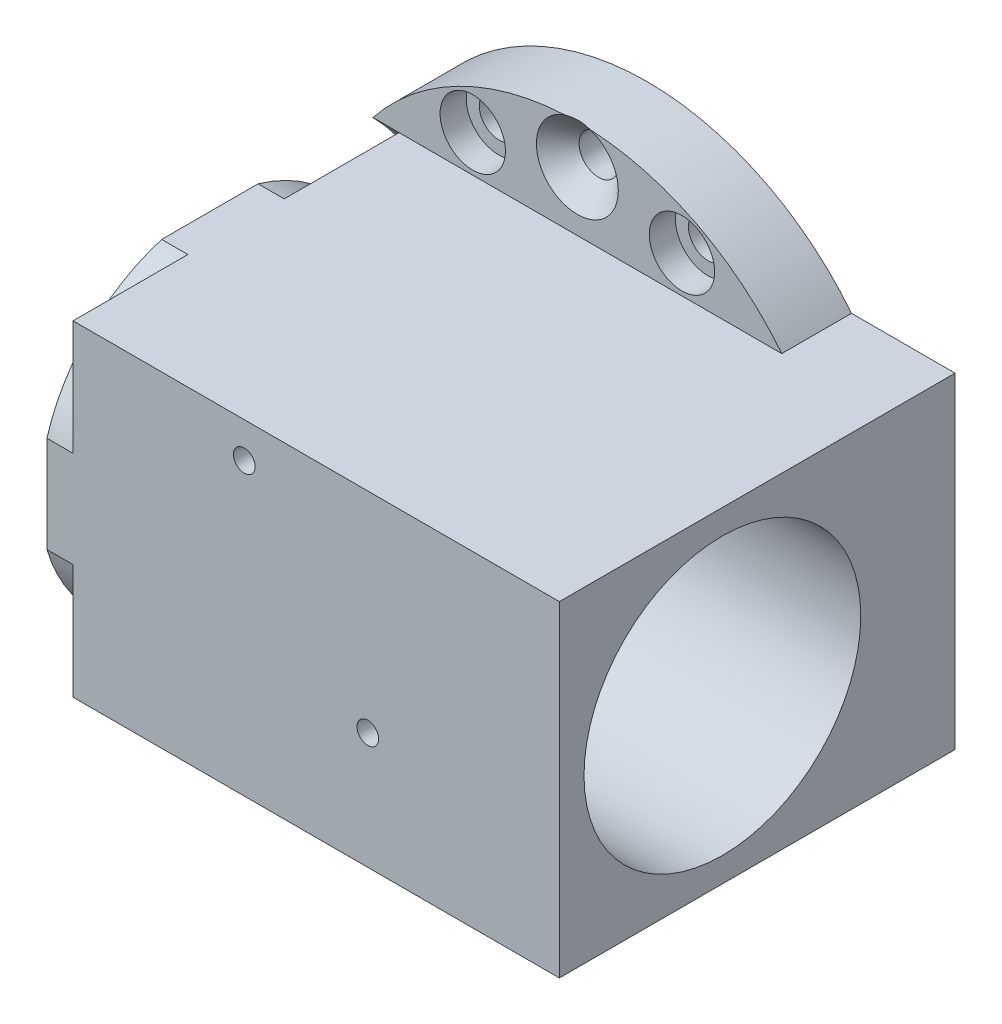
ISO-10303-21;
HEADER;
FILE_DESCRIPTION(('STEP AP214'),'2;1');
FILE_NAME('part.step','',(''),(''),'','','');
FILE_SCHEMA(('AUTOMOTIVE_DESIGN { 1 0 10303 214 1 1 1 1 }'));
ENDSEC;
DATA;
#1=APPLICATION_CONTEXT('core data for automotive mechanical design processes');
#2=APPLICATION_PROTOCOL_DEFINITION('international standard','automotive_design',2000,#1);
#3=PRODUCT_CONTEXT('',#1,'mechanical');
#4=PRODUCT('Part','Part','',(#3));
#5=PRODUCT_RELATED_PRODUCT_CATEGORY('part','',(#4));
#6=PRODUCT_DEFINITION_FORMATION('','',#4);
#7=PRODUCT_DEFINITION_CONTEXT('part definition',#1,'design');
#8=PRODUCT_DEFINITION('design','',#6,#7);
#9=PRODUCT_DEFINITION_SHAPE('','',#8);
#10=(LENGTH_UNIT() NAMED_UNIT(*) SI_UNIT(.MILLI.,.METRE.));
#11=(NAMED_UNIT(*) PLANE_ANGLE_UNIT() SI_UNIT($,.RADIAN.));
#12=(NAMED_UNIT(*) SI_UNIT($,.STERADIAN.) SOLID_ANGLE_UNIT());
#13=UNCERTAINTY_MEASURE_WITH_UNIT(LENGTH_MEASURE(1.E-05),#10,'distance_accuracy_value','');
#14=(GEOMETRIC_REPRESENTATION_CONTEXT(3) GLOBAL_UNCERTAINTY_ASSIGNED_CONTEXT((#13)) GLOBAL_UNIT_ASSIGNED_CONTEXT((#10,
#11,#12)) REPRESENTATION_CONTEXT('',''));
#15=CARTESIAN_POINT('',(0.,0.,0.));
#16=DIRECTION('',(0.,0.,1.));
#17=DIRECTION('',(1.,0.,0.));
#18=AXIS2_PLACEMENT_3D('',#15,#16,#17);
#19=CARTESIAN_POINT('',(-20.458687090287,0.,26.7));
#20=DIRECTION('',(1.,0.,0.));
#21=DIRECTION('',(0.,0.,-1.));
#22=AXIS2_PLACEMENT_3D('',#19,#20,#21);
#23=PLANE('',#22);
#24=CARTESIAN_POINT('',(-20.458687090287,0.,26.7));
#25=DIRECTION('',(-1.,0.,0.));
#26=DIRECTION('',(0.,0.,-1.));
#27=AXIS2_PLACEMENT_3D('',#24,#25,#26);
#28=CIRCLE('',#27,19.5);
#29=CARTESIAN_POINT('',(-20.458687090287,18.7,21.1718900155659));
#30=VERTEX_POINT('',#29);
#31=CARTESIAN_POINT('',(-20.458687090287,-18.7,21.1718900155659));
#32=VERTEX_POINT('',#31);
#33=EDGE_CURVE('E310',#30,#32,#28,.T.);
#34=ORIENTED_EDGE('',*,*,#33,.F.);
#35=DIRECTION('',(0.,0.,-1.));
#36=VECTOR('',#35,1.);
#37=CARTESIAN_POINT('',(-20.458687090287,18.7,45.4));
#38=LINE('',#37,#36);
#39=CARTESIAN_POINT('',(-20.458687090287,18.7,8.));
#40=VERTEX_POINT('',#39);
#41=EDGE_CURVE('E351',#30,#40,#38,.T.);
#42=ORIENTED_EDGE('',*,*,#41,.T.);
#43=CARTESIAN_POINT('',(-20.458687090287,0.,26.7));
#44=DIRECTION('',(1.,0.,0.));
#45=DIRECTION('',(0.,0.,-1.));
#46=AXIS2_PLACEMENT_3D('',#43,#44,#45);
#47=CIRCLE('',#46,26.4457936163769);
#48=CARTESIAN_POINT('',(-20.458687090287,-18.7,8.));
#49=VERTEX_POINT('',#48);
#50=EDGE_CURVE('E353',#49,#40,#47,.T.);
#51=ORIENTED_EDGE('',*,*,#50,.F.);
#52=DIRECTION('',(0.,0.,-1.));
#53=VECTOR('',#52,1.);
#54=CARTESIAN_POINT('',(-20.458687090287,-18.7,45.4));
#55=LINE('',#54,#53);
#56=EDGE_CURVE('E345',#32,#49,#55,.T.);
#57=ORIENTED_EDGE('',*,*,#56,.F.);
#58=EDGE_LOOP('',(#34,#42,#51,#57));
#59=FACE_BOUND('',#58,.T.);
#60=ADVANCED_FACE('F33',(#59),#23,.F.);
#61=CARTESIAN_POINT('',(0.,0.,8.));
#62=DIRECTION('',(0.,0.,1.));
#63=DIRECTION('',(1.,0.,0.));
#64=AXIS2_PLACEMENT_3D('',#61,#62,#63);
#65=PLANE('',#64);
#66=CARTESIAN_POINT('',(-12.,-22.95,8.));
#67=DIRECTION('',(0.,0.,1.));
#68=DIRECTION('',(1.,0.,0.));
#69=AXIS2_PLACEMENT_3D('',#66,#67,#68);
#70=CIRCLE('',#69,3.74999999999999);
#71=CARTESIAN_POINT('',(-8.25,-22.95,8.));
#72=VERTEX_POINT('',#71);
#73=EDGE_CURVE('E485',#72,#72,#70,.T.);
#74=ORIENTED_EDGE('',*,*,#73,.F.);
#75=EDGE_LOOP('',(#74));
#76=FACE_BOUND('',#75,.T.);
#77=CARTESIAN_POINT('',(12.,-22.95,8.));
#78=DIRECTION('',(0.,0.,1.));
#79=DIRECTION('',(1.,0.,0.));
#80=AXIS2_PLACEMENT_3D('',#77,#78,#79);
#81=CIRCLE('',#80,3.74999999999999);
#82=CARTESIAN_POINT('',(15.75,-22.95,8.));
#83=VERTEX_POINT('',#82);
#84=EDGE_CURVE('E473',#83,#83,#81,.T.);
#85=ORIENTED_EDGE('',*,*,#84,.F.);
#86=EDGE_LOOP('',(#85));
#87=FACE_BOUND('',#86,.T.);
#88=CARTESIAN_POINT('',(0.,-25.5,8.));
#89=DIRECTION('',(0.,0.,1.));
#90=DIRECTION('',(1.,0.,0.));
#91=AXIS2_PLACEMENT_3D('',#88,#89,#90);
#92=CIRCLE('',#91,4.69999999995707);
#93=CARTESIAN_POINT('',(1.47085153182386,-29.9639215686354,8.));
#94=VERTEX_POINT('',#93);
#95=CARTESIAN_POINT('',(-1.4708515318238,-29.9639215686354,8.));
#96=VERTEX_POINT('',#95);
#97=EDGE_CURVE('E58',#94,#96,#92,.T.);
#98=ORIENTED_EDGE('',*,*,#97,.F.);
#99=CARTESIAN_POINT('',(0.,0.,8.));
#100=DIRECTION('',(0.,0.,1.));
#101=DIRECTION('',(1.,0.,0.));
#102=AXIS2_PLACEMENT_3D('',#99,#100,#101);
#103=CIRCLE('',#102,30.);
#104=CARTESIAN_POINT('',(23.458687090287,-18.7,8.));
#105=VERTEX_POINT('',#104);
#106=EDGE_CURVE('E167',#94,#105,#103,.T.);
#107=ORIENTED_EDGE('',*,*,#106,.T.);
#108=DIRECTION('',(1.,0.,0.));
#109=VECTOR('',#108,1.);
#110=CARTESIAN_POINT('',(35.341312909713,-18.7,8.));
#111=LINE('',#110,#109);
#112=EDGE_CURVE('E335',#49,#105,#111,.T.);
#113=ORIENTED_EDGE('',*,*,#112,.F.);
#114=DIRECTION('',(1.,0.,0.));
#115=VECTOR('',#114,1.);
#116=CARTESIAN_POINT('',(-61.6523687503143,-18.7,7.99999999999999));
#117=LINE('',#116,#115);
#118=CARTESIAN_POINT('',(-23.458687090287,-18.7,7.99999999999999));
#119=VERTEX_POINT('',#118);
#120=EDGE_CURVE('E356',#119,#49,#117,.T.);
#121=ORIENTED_EDGE('',*,*,#120,.F.);
#122=EDGE_CURVE('E174',#119,#96,#103,.T.);
#123=ORIENTED_EDGE('',*,*,#122,.T.);
#124=EDGE_LOOP('',(#98,#107,#113,#121,#123));
#125=FACE_BOUND('',#124,.T.);
#126=ADVANCED_FACE('F261',(#76,#87,#125),#65,.T.);
#127=CARTESIAN_POINT('',(12.,22.95,8.));
#128=DIRECTION('',(0.,0.,1.));
#129=DIRECTION('',(1.,0.,0.));
#130=AXIS2_PLACEMENT_3D('',#127,#128,#129);
#131=CIRCLE('',#130,3.74999999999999);
#132=CARTESIAN_POINT('',(15.75,22.95,8.));
#133=VERTEX_POINT('',#132);
#134=EDGE_CURVE('E509',#133,#133,#131,.T.);
#135=ORIENTED_EDGE('',*,*,#134,.F.);
#136=EDGE_LOOP('',(#135));
#137=FACE_BOUND('',#136,.T.);
#138=CARTESIAN_POINT('',(-12.,22.95,8.));
#139=DIRECTION('',(0.,0.,1.));
#140=DIRECTION('',(1.,0.,0.));
#141=AXIS2_PLACEMENT_3D('',#138,#139,#140);
#142=CIRCLE('',#141,3.74999999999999);
#143=CARTESIAN_POINT('',(-8.25000000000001,22.95,8.));
#144=VERTEX_POINT('',#143);
#145=EDGE_CURVE('E497',#144,#144,#142,.T.);
#146=ORIENTED_EDGE('',*,*,#145,.F.);
#147=EDGE_LOOP('',(#146));
#148=FACE_BOUND('',#147,.T.);
#149=CARTESIAN_POINT('',(0.,25.5,8.));
#150=DIRECTION('',(0.,0.,1.));
#151=DIRECTION('',(1.,0.,0.));
#152=AXIS2_PLACEMENT_3D('',#149,#150,#151);
#153=CIRCLE('',#152,4.69999999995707);
#154=CARTESIAN_POINT('',(-1.47085153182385,29.9639215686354,8.));
#155=VERTEX_POINT('',#154);
#156=CARTESIAN_POINT('',(1.47085153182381,29.9639215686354,8.));
#157=VERTEX_POINT('',#156);
#158=EDGE_CURVE('E51',#155,#157,#153,.T.);
#159=ORIENTED_EDGE('',*,*,#158,.F.);
#160=CARTESIAN_POINT('',(0.,0.,8.));
#161=DIRECTION('',(0.,0.,1.));
#162=DIRECTION('',(1.,0.,0.));
#163=AXIS2_PLACEMENT_3D('',#160,#161,#162);
#164=CIRCLE('',#163,30.);
#165=CARTESIAN_POINT('',(-23.458687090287,18.7,7.99999999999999));
#166=VERTEX_POINT('',#165);
#167=EDGE_CURVE('E156',#155,#166,#164,.T.);
#168=ORIENTED_EDGE('',*,*,#167,.T.);
#169=DIRECTION('',(1.,0.,0.));
#170=VECTOR('',#169,1.);
#171=CARTESIAN_POINT('',(-61.6523687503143,18.7,7.99999999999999));
#172=LINE('',#171,#170);
#173=EDGE_CURVE('E165',#166,#40,#172,.T.);
#174=ORIENTED_EDGE('',*,*,#173,.T.);
#175=DIRECTION('',(-1.,0.,0.));
#176=VECTOR('',#175,1.);
#177=CARTESIAN_POINT('',(-20.458687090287,18.7,8.));
#178=LINE('',#177,#176);
#179=CARTESIAN_POINT('',(23.458687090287,18.7,8.));
#180=VERTEX_POINT('',#179);
#181=EDGE_CURVE('E339',#180,#40,#178,.T.);
#182=ORIENTED_EDGE('',*,*,#181,.F.);
#183=EDGE_CURVE('E158',#180,#157,#164,.T.);
#184=ORIENTED_EDGE('',*,*,#183,.T.);
#185=EDGE_LOOP('',(#159,#168,#174,#182,#184));
#186=FACE_BOUND('',#185,.T.);
#187=ADVANCED_FACE('F154',(#137,#148,#186),#65,.T.);
#188=CARTESIAN_POINT('',(0.,0.,0.));
#189=DIRECTION('',(0.,0.,1.));
#190=DIRECTION('',(1.,0.,0.));
#191=AXIS2_PLACEMENT_3D('',#188,#189,#190);
#192=CYLINDRICAL_SURFACE('',#191,30.);
#193=CARTESIAN_POINT('',(1.47160231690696,29.9638847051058,8.00020000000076));
#194=CARTESIAN_POINT('',(1.39386172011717,29.9677027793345,7.97948521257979));
#195=CARTESIAN_POINT('',(1.31573580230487,29.971236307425,7.96017864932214));
#196=CARTESIAN_POINT('',(1.15875657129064,29.9777160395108,7.92458632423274));
#197=CARTESIAN_POINT('',(1.07990309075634,29.9806621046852,7.90830127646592));
#198=CARTESIAN_POINT('',(0.842264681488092,29.9885928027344,7.86427902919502));
#199=CARTESIAN_POINT('',(0.682506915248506,29.9926647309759,7.84140326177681));
#200=CARTESIAN_POINT('',(0.365301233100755,29.9981855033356,7.81029691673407));
#201=CARTESIAN_POINT('',(0.207886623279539,29.9996934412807,7.80173648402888));
#202=CARTESIAN_POINT('',(-0.106990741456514,30.0002217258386,7.79874422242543));
#203=CARTESIAN_POINT('',(-0.264453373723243,29.9992439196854,7.80430190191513));
#204=CARTESIAN_POINT('',(-0.50945815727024,29.9958037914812,7.82372011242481));
#205=CARTESIAN_POINT('',(-0.597416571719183,29.994179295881,7.83287766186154));
#206=CARTESIAN_POINT('',(-0.772786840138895,29.9901731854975,7.85535907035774));
#207=CARTESIAN_POINT('',(-0.86019869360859,29.9877915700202,7.86868293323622));
#208=CARTESIAN_POINT('',(-1.03546134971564,29.9822549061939,7.89948261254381));
#209=CARTESIAN_POINT('',(-1.12330242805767,29.9790899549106,7.91701149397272));
#210=CARTESIAN_POINT('',(-1.29812798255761,29.972029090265,7.9558444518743));
#211=CARTESIAN_POINT('',(-1.38511236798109,29.9681331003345,7.97714892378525));
#212=CARTESIAN_POINT('',(-1.47160231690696,29.9638847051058,8.00020000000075));
#213=B_SPLINE_CURVE_WITH_KNOTS('',3,(#193,#194,#195,#196,#197,#198,#199,#200,#201,#202,#203,
#204,#205,#206,#207,#208,#209,#210,#211,#212),.UNSPECIFIED.,.F.,.F.,(4,2,2,2,2,2,2,2,2,4),(0.,
0.241605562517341,0.483268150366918,0.966919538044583,1.43926475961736,1.91125906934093,
2.17651538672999,2.44177194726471,2.71057045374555,2.97939712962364),.UNSPECIFIED.);
#214=EDGE_CURVE('E11',#157,#155,#213,.T.);
#215=ORIENTED_EDGE('',*,*,#214,.F.);
#216=ORIENTED_EDGE('',*,*,#183,.F.);
#217=DIRECTION('',(0.,0.,1.));
#218=VECTOR('',#217,1.);
#219=CARTESIAN_POINT('',(23.458687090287,18.7,0.));
#220=LINE('',#219,#218);
#221=CARTESIAN_POINT('',(23.458687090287,18.7,0.));
#222=VERTEX_POINT('',#221);
#223=EDGE_CURVE('E178',#222,#180,#220,.T.);
#224=ORIENTED_EDGE('',*,*,#223,.F.);
#225=CARTESIAN_POINT('',(0.,0.,0.));
#226=DIRECTION('',(0.,0.,1.));
#227=DIRECTION('',(1.,0.,0.));
#228=AXIS2_PLACEMENT_3D('',#225,#226,#227);
#229=CIRCLE('',#228,30.);
#230=CARTESIAN_POINT('',(-23.458687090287,18.7,0.));
#231=VERTEX_POINT('',#230);
#232=EDGE_CURVE('E177',#222,#231,#229,.T.);
#233=ORIENTED_EDGE('',*,*,#232,.T.);
#234=DIRECTION('',(0.,0.,1.));
#235=VECTOR('',#234,1.);
#236=CARTESIAN_POINT('',(-23.458687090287,18.7,0.));
#237=LINE('',#236,#235);
#238=EDGE_CURVE('E164',#231,#166,#237,.T.);
#239=ORIENTED_EDGE('',*,*,#238,.T.);
#240=ORIENTED_EDGE('',*,*,#167,.F.);
#241=EDGE_LOOP('',(#215,#216,#224,#233,#239,#240));
#242=FACE_BOUND('',#241,.T.);
#243=ADVANCED_FACE('F35',(#242),#192,.T.);
#244=CARTESIAN_POINT('',(35.341312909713,18.7,0.));
#245=DIRECTION('',(0.,1.,0.));
#246=DIRECTION('',(-1.,0.,0.));
#247=AXIS2_PLACEMENT_3D('',#244,#245,#246);
#248=PLANE('',#247);
#249=DIRECTION('',(-1.,0.,0.));
#250=VECTOR('',#249,1.);
#251=CARTESIAN_POINT('',(-20.458687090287,18.7,32.2281099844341));
#252=LINE('',#251,#250);
#253=CARTESIAN_POINT('',(-20.458687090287,18.7,32.2281099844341));
#254=VERTEX_POINT('',#253);
#255=CARTESIAN_POINT('',(-23.458687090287,18.7,32.2281099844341));
#256=VERTEX_POINT('',#255);
#257=EDGE_CURVE('E396',#254,#256,#252,.T.);
#258=ORIENTED_EDGE('',*,*,#257,.F.);
#259=DIRECTION('',(0.,0.,-1.));
#260=VECTOR('',#259,1.);
#261=CARTESIAN_POINT('',(-20.458687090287,18.7,45.4));
#262=LINE('',#261,#260);
#263=CARTESIAN_POINT('',(-20.458687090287,18.7,45.4));
#264=VERTEX_POINT('',#263);
#265=EDGE_CURVE('E403',#264,#254,#262,.T.);
#266=ORIENTED_EDGE('',*,*,#265,.F.);
#267=DIRECTION('',(-1.,0.,0.));
#268=VECTOR('',#267,1.);
#269=CARTESIAN_POINT('',(-20.458687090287,18.7,45.4));
#270=LINE('',#269,#268);
#271=CARTESIAN_POINT('',(35.341312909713,18.7,45.4));
#272=VERTEX_POINT('',#271);
#273=EDGE_CURVE('E342',#272,#264,#270,.T.);
#274=ORIENTED_EDGE('',*,*,#273,.F.);
#275=DIRECTION('',(0.,0.,1.));
#276=VECTOR('',#275,1.);
#277=CARTESIAN_POINT('',(35.341312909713,18.7,0.));
#278=LINE('',#277,#276);
#279=CARTESIAN_POINT('',(35.341312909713,18.7,0.));
#280=VERTEX_POINT('',#279);
#281=EDGE_CURVE('E181',#280,#272,#278,.T.);
#282=ORIENTED_EDGE('',*,*,#281,.F.);
#283=DIRECTION('',(-1.,0.,0.));
#284=VECTOR('',#283,1.);
#285=CARTESIAN_POINT('',(35.341312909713,18.7,0.));
#286=LINE('',#285,#284);
#287=EDGE_CURVE('E172',#280,#222,#286,.T.);
#288=ORIENTED_EDGE('',*,*,#287,.T.);
#289=ORIENTED_EDGE('',*,*,#223,.T.);
#290=ORIENTED_EDGE('',*,*,#181,.T.);
#291=ORIENTED_EDGE('',*,*,#41,.F.);
#292=DIRECTION('',(1.,0.,0.));
#293=VECTOR('',#292,1.);
#294=CARTESIAN_POINT('',(-23.458687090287,18.7,21.1718900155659));
#295=LINE('',#294,#293);
#296=CARTESIAN_POINT('',(-23.458687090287,18.7,21.1718900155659));
#297=VERTEX_POINT('',#296);
#298=EDGE_CURVE('E329',#297,#30,#295,.T.);
#299=ORIENTED_EDGE('',*,*,#298,.F.);
#300=DIRECTION('',(0.,0.,-1.));
#301=VECTOR('',#300,1.);
#302=CARTESIAN_POINT('',(-23.458687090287,18.7,21.1718900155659));
#303=LINE('',#302,#301);
#304=EDGE_CURVE('E323',#256,#297,#303,.T.);
#305=ORIENTED_EDGE('',*,*,#304,.F.);
#306=EDGE_LOOP('',(#258,#266,#274,#282,#288,#289,#290,#291,#299,#305));
#307=FACE_BOUND('',#306,.T.);
#308=ADVANCED_FACE('F274',(#307),#248,.T.);
#309=CARTESIAN_POINT('',(35.341312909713,-18.7,0.));
#310=DIRECTION('',(1.,0.,0.));
#311=DIRECTION('',(0.,1.,0.));
#312=AXIS2_PLACEMENT_3D('',#309,#310,#311);
#313=PLANE('',#312);
#314=CARTESIAN_POINT('',(35.341312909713,0.,26.7));
#315=DIRECTION('',(1.,0.,0.));
#316=DIRECTION('',(0.,1.,0.));
#317=AXIS2_PLACEMENT_3D('',#314,#315,#316);
#318=CIRCLE('',#317,15.875);
#319=CARTESIAN_POINT('',(35.341312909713,15.875,26.7));
#320=VERTEX_POINT('',#319);
#321=EDGE_CURVE('E406',#320,#320,#318,.T.);
#322=ORIENTED_EDGE('',*,*,#321,.F.);
#323=EDGE_LOOP('',(#322));
#324=FACE_BOUND('',#323,.T.);
#325=ORIENTED_EDGE('',*,*,#281,.T.);
#326=DIRECTION('',(0.,1.,0.));
#327=VECTOR('',#326,1.);
#328=CARTESIAN_POINT('',(35.341312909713,18.7,45.4));
#329=LINE('',#328,#327);
#330=CARTESIAN_POINT('',(35.341312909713,-18.7,45.4));
#331=VERTEX_POINT('',#330);
#332=EDGE_CURVE('E338',#331,#272,#329,.T.);
#333=ORIENTED_EDGE('',*,*,#332,.F.);
#334=DIRECTION('',(0.,0.,1.));
#335=VECTOR('',#334,1.);
#336=CARTESIAN_POINT('',(35.341312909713,-18.7,0.));
#337=LINE('',#336,#335);
#338=CARTESIAN_POINT('',(35.341312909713,-18.7,0.));
#339=VERTEX_POINT('',#338);
#340=EDGE_CURVE('E183',#339,#331,#337,.T.);
#341=ORIENTED_EDGE('',*,*,#340,.F.);
#342=DIRECTION('',(0.,1.,0.));
#343=VECTOR('',#342,1.);
#344=CARTESIAN_POINT('',(35.341312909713,-18.7,0.));
#345=LINE('',#344,#343);
#346=EDGE_CURVE('E370',#339,#280,#345,.T.);
#347=ORIENTED_EDGE('',*,*,#346,.T.);
#348=EDGE_LOOP('',(#325,#333,#341,#347));
#349=FACE_BOUND('',#348,.T.);
#350=ADVANCED_FACE('F277',(#324,#349),#313,.T.);
#351=CARTESIAN_POINT('',(23.458687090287,-18.7,0.));
#352=DIRECTION('',(0.,-1.,0.));
#353=DIRECTION('',(0.,0.,-1.));
#354=AXIS2_PLACEMENT_3D('',#351,#352,#353);
#355=PLANE('',#354);
#356=CARTESIAN_POINT('',(-12.4586870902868,-18.7,39.4000000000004));
#357=DIRECTION('',(0.,-1.,0.));
#358=DIRECTION('',(0.,0.,-1.));
#359=AXIS2_PLACEMENT_3D('',#356,#357,#358);
#360=CIRCLE('',#359,1.64999999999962);
#361=CARTESIAN_POINT('',(-12.4586870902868,-18.7,37.7500000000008));
#362=VERTEX_POINT('',#361);
#363=EDGE_CURVE('E291',#362,#362,#360,.T.);
#364=ORIENTED_EDGE('',*,*,#363,.F.);
#365=EDGE_LOOP('',(#364));
#366=FACE_BOUND('',#365,.T.);
#367=CARTESIAN_POINT('',(29.4413129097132,-18.7,39.4000000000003));
#368=DIRECTION('',(0.,-1.,0.));
#369=DIRECTION('',(0.,0.,-1.));
#370=AXIS2_PLACEMENT_3D('',#367,#368,#369);
#371=CIRCLE('',#370,1.64999999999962);
#372=CARTESIAN_POINT('',(29.4413129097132,-18.7,37.7500000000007));
#373=VERTEX_POINT('',#372);
#374=EDGE_CURVE('E295',#373,#373,#371,.T.);
#375=ORIENTED_EDGE('',*,*,#374,.F.);
#376=EDGE_LOOP('',(#375));
#377=FACE_BOUND('',#376,.T.);
#378=CARTESIAN_POINT('',(29.4413129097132,-18.7,5.90000000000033));
#379=DIRECTION('',(0.,-1.,0.));
#380=DIRECTION('',(0.,0.,-1.));
#381=AXIS2_PLACEMENT_3D('',#378,#379,#380);
#382=CIRCLE('',#381,1.64999999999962);
#383=CARTESIAN_POINT('',(29.4413129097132,-18.7,4.25000000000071));
#384=VERTEX_POINT('',#383);
#385=EDGE_CURVE('E299',#384,#384,#382,.T.);
#386=ORIENTED_EDGE('',*,*,#385,.F.);
#387=EDGE_LOOP('',(#386));
#388=FACE_BOUND('',#387,.T.);
#389=DIRECTION('',(-1.,0.,0.));
#390=VECTOR('',#389,1.);
#391=CARTESIAN_POINT('',(-20.458687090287,-18.7,32.2281099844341));
#392=LINE('',#391,#390);
#393=CARTESIAN_POINT('',(-20.458687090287,-18.7,32.2281099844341));
#394=VERTEX_POINT('',#393);
#395=CARTESIAN_POINT('',(-23.458687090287,-18.7,32.2281099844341));
#396=VERTEX_POINT('',#395);
#397=EDGE_CURVE('E302',#394,#396,#392,.T.);
#398=ORIENTED_EDGE('',*,*,#397,.T.);
#399=DIRECTION('',(0.,0.,1.));
#400=VECTOR('',#399,1.);
#401=CARTESIAN_POINT('',(-23.458687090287,-18.7,45.4));
#402=LINE('',#401,#400);
#403=CARTESIAN_POINT('',(-23.458687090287,-18.7,21.1718900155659));
#404=VERTEX_POINT('',#403);
#405=EDGE_CURVE('E304',#404,#396,#402,.T.);
#406=ORIENTED_EDGE('',*,*,#405,.F.);
#407=DIRECTION('',(1.,0.,0.));
#408=VECTOR('',#407,1.);
#409=CARTESIAN_POINT('',(-23.458687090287,-18.7,21.1718900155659));
#410=LINE('',#409,#408);
#411=EDGE_CURVE('E333',#404,#32,#410,.T.);
#412=ORIENTED_EDGE('',*,*,#411,.T.);
#413=ORIENTED_EDGE('',*,*,#56,.T.);
#414=ORIENTED_EDGE('',*,*,#112,.T.);
#415=DIRECTION('',(0.,0.,1.));
#416=VECTOR('',#415,1.);
#417=CARTESIAN_POINT('',(23.458687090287,-18.7,0.));
#418=LINE('',#417,#416);
#419=CARTESIAN_POINT('',(23.458687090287,-18.7,0.));
#420=VERTEX_POINT('',#419);
#421=EDGE_CURVE('E186',#420,#105,#418,.T.);
#422=ORIENTED_EDGE('',*,*,#421,.F.);
#423=DIRECTION('',(1.,0.,0.));
#424=VECTOR('',#423,1.);
#425=CARTESIAN_POINT('',(23.458687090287,-18.7,0.));
#426=LINE('',#425,#424);
#427=EDGE_CURVE('E368',#420,#339,#426,.T.);
#428=ORIENTED_EDGE('',*,*,#427,.T.);
#429=ORIENTED_EDGE('',*,*,#340,.T.);
#430=DIRECTION('',(1.,0.,0.));
#431=VECTOR('',#430,1.);
#432=CARTESIAN_POINT('',(35.341312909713,-18.7,45.4));
#433=LINE('',#432,#431);
#434=CARTESIAN_POINT('',(-20.458687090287,-18.7,45.4));
#435=VERTEX_POINT('',#434);
#436=EDGE_CURVE('E336',#435,#331,#433,.T.);
#437=ORIENTED_EDGE('',*,*,#436,.F.);
#438=DIRECTION('',(0.,0.,1.));
#439=VECTOR('',#438,1.);
#440=CARTESIAN_POINT('',(-20.458687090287,-18.7,32.2281099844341));
#441=LINE('',#440,#439);
#442=EDGE_CURVE('E307',#394,#435,#441,.T.);
#443=ORIENTED_EDGE('',*,*,#442,.F.);
#444=EDGE_LOOP('',(#398,#406,#412,#413,#414,#422,#428,#429,#437,#443));
#445=FACE_BOUND('',#444,.T.);
#446=ADVANCED_FACE('F280',(#366,#377,#388,#445),#355,.T.);
#447=CARTESIAN_POINT('',(0.,0.,0.));
#448=DIRECTION('',(0.,0.,1.));
#449=DIRECTION('',(1.,0.,0.));
#450=AXIS2_PLACEMENT_3D('',#447,#448,#449);
#451=CYLINDRICAL_SURFACE('',#450,30.);
#452=CARTESIAN_POINT('',(-1.47160231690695,-29.9638847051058,8.00020000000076));
#453=CARTESIAN_POINT('',(-1.39386172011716,-29.9677027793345,7.97948521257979));
#454=CARTESIAN_POINT('',(-1.31573580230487,-29.971236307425,7.96017864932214));
#455=CARTESIAN_POINT('',(-1.15875657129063,-29.9777160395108,7.92458632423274));
#456=CARTESIAN_POINT('',(-1.07990309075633,-29.9806621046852,7.90830127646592));
#457=CARTESIAN_POINT('',(-0.842264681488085,-29.9885928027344,7.86427902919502));
#458=CARTESIAN_POINT('',(-0.682506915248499,-29.9926647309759,7.84140326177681));
#459=CARTESIAN_POINT('',(-0.365301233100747,-29.9981855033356,7.81029691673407));
#460=CARTESIAN_POINT('',(-0.207886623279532,-29.9996934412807,7.80173648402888));
#461=CARTESIAN_POINT('',(0.106990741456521,-30.0002217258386,7.79874422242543));
#462=CARTESIAN_POINT('',(0.26445337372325,-29.9992439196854,7.80430190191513));
#463=CARTESIAN_POINT('',(0.509458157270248,-29.9958037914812,7.82372011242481));
#464=CARTESIAN_POINT('',(0.597416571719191,-29.994179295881,7.83287766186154));
#465=CARTESIAN_POINT('',(0.772786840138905,-29.9901731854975,7.85535907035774));
#466=CARTESIAN_POINT('',(0.8601986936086,-29.9877915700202,7.86868293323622));
#467=CARTESIAN_POINT('',(1.03546134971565,-29.9822549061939,7.89948261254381));
#468=CARTESIAN_POINT('',(1.12330242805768,-29.9790899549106,7.91701149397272));
#469=CARTESIAN_POINT('',(1.29812798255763,-29.972029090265,7.9558444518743));
#470=CARTESIAN_POINT('',(1.3851123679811,-29.9681331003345,7.97714892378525));
#471=CARTESIAN_POINT('',(1.47160231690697,-29.9638847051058,8.00020000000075));
#472=B_SPLINE_CURVE_WITH_KNOTS('',3,(#452,#453,#454,#455,#456,#457,#458,#459,#460,#461,#462,
#463,#464,#465,#466,#467,#468,#469,#470,#471),.UNSPECIFIED.,.F.,.F.,(4,2,2,2,2,2,2,2,2,4),(0.,
0.241605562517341,0.483268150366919,0.966919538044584,1.43926475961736,1.91125906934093,
2.17651538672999,2.44177194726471,2.71057045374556,2.97939712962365),.UNSPECIFIED.);
#473=EDGE_CURVE('E46',#96,#94,#472,.T.);
#474=ORIENTED_EDGE('',*,*,#473,.F.);
#475=ORIENTED_EDGE('',*,*,#122,.F.);
#476=DIRECTION('',(0.,0.,1.));
#477=VECTOR('',#476,1.);
#478=CARTESIAN_POINT('',(-23.458687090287,-18.7,0.));
#479=LINE('',#478,#477);
#480=CARTESIAN_POINT('',(-23.458687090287,-18.7,0.));
#481=VERTEX_POINT('',#480);
#482=EDGE_CURVE('E189',#481,#119,#479,.T.);
#483=ORIENTED_EDGE('',*,*,#482,.F.);
#484=CARTESIAN_POINT('',(0.,0.,0.));
#485=DIRECTION('',(0.,0.,1.));
#486=DIRECTION('',(1.,0.,0.));
#487=AXIS2_PLACEMENT_3D('',#484,#485,#486);
#488=CIRCLE('',#487,30.);
#489=EDGE_CURVE('E365',#481,#420,#488,.T.);
#490=ORIENTED_EDGE('',*,*,#489,.T.);
#491=ORIENTED_EDGE('',*,*,#421,.T.);
#492=ORIENTED_EDGE('',*,*,#106,.F.);
#493=EDGE_LOOP('',(#474,#475,#483,#490,#491,#492));
#494=FACE_BOUND('',#493,.T.);
#495=ADVANCED_FACE('F197',(#494),#451,.T.);
#496=CARTESIAN_POINT('',(-23.458687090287,18.7,0.));
#497=DIRECTION('',(-1.,0.,0.));
#498=DIRECTION('',(0.,0.,1.));
#499=AXIS2_PLACEMENT_3D('',#496,#497,#498);
#500=PLANE('',#499);
#501=CARTESIAN_POINT('',(-23.458687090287,0.,26.7));
#502=DIRECTION('',(-1.,0.,0.));
#503=DIRECTION('',(0.,0.,1.));
#504=AXIS2_PLACEMENT_3D('',#501,#502,#503);
#505=CIRCLE('',#504,26.4457936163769);
#506=EDGE_CURVE('E168',#119,#166,#505,.F.);
#507=ORIENTED_EDGE('',*,*,#506,.T.);
#508=ORIENTED_EDGE('',*,*,#238,.F.);
#509=DIRECTION('',(0.,-1.,0.));
#510=VECTOR('',#509,1.);
#511=CARTESIAN_POINT('',(-23.458687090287,18.7,0.));
#512=LINE('',#511,#510);
#513=EDGE_CURVE('E362',#231,#481,#512,.T.);
#514=ORIENTED_EDGE('',*,*,#513,.T.);
#515=ORIENTED_EDGE('',*,*,#482,.T.);
#516=EDGE_LOOP('',(#507,#508,#514,#515));
#517=FACE_BOUND('',#516,.T.);
#518=ADVANCED_FACE('F269',(#517),#500,.T.);
#519=CARTESIAN_POINT('',(0.,0.,0.));
#520=DIRECTION('',(0.,0.,1.));
#521=DIRECTION('',(1.,0.,0.));
#522=AXIS2_PLACEMENT_3D('',#519,#520,#521);
#523=PLANE('',#522);
#524=CARTESIAN_POINT('',(12.,22.95,0.));
#525=DIRECTION('',(0.,0.,1.));
#526=DIRECTION('',(1.,0.,0.));
#527=AXIS2_PLACEMENT_3D('',#524,#525,#526);
#528=CIRCLE('',#527,2.25000000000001);
#529=CARTESIAN_POINT('',(14.25,22.95,0.));
#530=VERTEX_POINT('',#529);
#531=EDGE_CURVE('E500',#530,#530,#528,.T.);
#532=ORIENTED_EDGE('',*,*,#531,.T.);
#533=EDGE_LOOP('',(#532));
#534=FACE_BOUND('',#533,.T.);
#535=CARTESIAN_POINT('',(-12.,22.95,0.));
#536=DIRECTION('',(0.,0.,1.));
#537=DIRECTION('',(1.,0.,0.));
#538=AXIS2_PLACEMENT_3D('',#535,#536,#537);
#539=CIRCLE('',#538,2.25000000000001);
#540=CARTESIAN_POINT('',(-9.74999999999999,22.95,0.));
#541=VERTEX_POINT('',#540);
#542=EDGE_CURVE('E488',#541,#541,#539,.T.);
#543=ORIENTED_EDGE('',*,*,#542,.T.);
#544=EDGE_LOOP('',(#543));
#545=FACE_BOUND('',#544,.T.);
#546=CARTESIAN_POINT('',(-12.,-22.95,0.));
#547=DIRECTION('',(0.,0.,1.));
#548=DIRECTION('',(1.,0.,0.));
#549=AXIS2_PLACEMENT_3D('',#546,#547,#548);
#550=CIRCLE('',#549,2.25000000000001);
#551=CARTESIAN_POINT('',(-9.74999999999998,-22.95,0.));
#552=VERTEX_POINT('',#551);
#553=EDGE_CURVE('E476',#552,#552,#550,.T.);
#554=ORIENTED_EDGE('',*,*,#553,.T.);
#555=EDGE_LOOP('',(#554));
#556=FACE_BOUND('',#555,.T.);
#557=CARTESIAN_POINT('',(12.,-22.95,0.));
#558=DIRECTION('',(0.,0.,1.));
#559=DIRECTION('',(1.,0.,0.));
#560=AXIS2_PLACEMENT_3D('',#557,#558,#559);
#561=CIRCLE('',#560,2.25000000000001);
#562=CARTESIAN_POINT('',(14.25,-22.95,0.));
#563=VERTEX_POINT('',#562);
#564=EDGE_CURVE('E464',#563,#563,#561,.T.);
#565=ORIENTED_EDGE('',*,*,#564,.T.);
#566=EDGE_LOOP('',(#565));
#567=FACE_BOUND('',#566,.T.);
#568=CARTESIAN_POINT('',(0.,25.5,0.));
#569=DIRECTION('',(0.,0.,1.));
#570=DIRECTION('',(1.,0.,0.));
#571=AXIS2_PLACEMENT_3D('',#568,#569,#570);
#572=CIRCLE('',#571,2.24999999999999);
#573=CARTESIAN_POINT('',(2.24999999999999,25.5,0.));
#574=VERTEX_POINT('',#573);
#575=EDGE_CURVE('E448',#574,#574,#572,.T.);
#576=ORIENTED_EDGE('',*,*,#575,.T.);
#577=EDGE_LOOP('',(#576));
#578=FACE_BOUND('',#577,.T.);
#579=CARTESIAN_POINT('',(0.,-25.5,0.));
#580=DIRECTION('',(0.,0.,1.));
#581=DIRECTION('',(1.,0.,0.));
#582=AXIS2_PLACEMENT_3D('',#579,#580,#581);
#583=CIRCLE('',#582,2.24999999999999);
#584=CARTESIAN_POINT('',(2.24999999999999,-25.5,0.));
#585=VERTEX_POINT('',#584);
#586=EDGE_CURVE('E441',#585,#585,#583,.T.);
#587=ORIENTED_EDGE('',*,*,#586,.T.);
#588=EDGE_LOOP('',(#587));
#589=FACE_BOUND('',#588,.T.);
#590=ORIENTED_EDGE('',*,*,#232,.F.);
#591=ORIENTED_EDGE('',*,*,#287,.F.);
#592=ORIENTED_EDGE('',*,*,#346,.F.);
#593=ORIENTED_EDGE('',*,*,#427,.F.);
#594=ORIENTED_EDGE('',*,*,#489,.F.);
#595=ORIENTED_EDGE('',*,*,#513,.F.);
#596=EDGE_LOOP('',(#590,#591,#592,#593,#594,#595));
#597=FACE_BOUND('',#596,.T.);
#598=ADVANCED_FACE('F265',(#534,#545,#556,#567,#578,#589,#597),#523,.F.);
#599=CARTESIAN_POINT('',(-61.6523687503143,0.,26.7));
#600=DIRECTION('',(1.,0.,0.));
#601=DIRECTION('',(0.,0.,-1.));
#602=AXIS2_PLACEMENT_3D('',#599,#600,#601);
#603=CYLINDRICAL_SURFACE('',#602,26.4457936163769);
#604=ORIENTED_EDGE('',*,*,#120,.T.);
#605=ORIENTED_EDGE('',*,*,#50,.T.);
#606=ORIENTED_EDGE('',*,*,#173,.F.);
#607=ORIENTED_EDGE('',*,*,#506,.F.);
#608=EDGE_LOOP('',(#604,#605,#606,#607));
#609=FACE_BOUND('',#608,.T.);
#610=ADVANCED_FACE('F257',(#609),#603,.F.);
#611=CARTESIAN_POINT('',(0.,0.,45.4));
#612=DIRECTION('',(0.,0.,-1.));
#613=DIRECTION('',(-1.,0.,0.));
#614=AXIS2_PLACEMENT_3D('',#611,#612,#613);
#615=PLANE('',#614);
#616=CARTESIAN_POINT('',(13.361312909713,-5.33,45.4));
#617=DIRECTION('',(0.,0.,1.));
#618=DIRECTION('',(1.,0.,0.));
#619=AXIS2_PLACEMENT_3D('',#616,#617,#618);
#620=CIRCLE('',#619,1.24999999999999);
#621=CARTESIAN_POINT('',(14.611312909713,-5.33,45.4));
#622=VERTEX_POINT('',#621);
#623=EDGE_CURVE('E525',#622,#622,#620,.T.);
#624=ORIENTED_EDGE('',*,*,#623,.F.);
#625=EDGE_LOOP('',(#624));
#626=FACE_BOUND('',#625,.T.);
#627=CARTESIAN_POINT('',(-0.808687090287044,14.63,45.4));
#628=DIRECTION('',(0.,0.,1.));
#629=DIRECTION('',(1.,0.,0.));
#630=AXIS2_PLACEMENT_3D('',#627,#628,#629);
#631=CIRCLE('',#630,1.24999999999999);
#632=CARTESIAN_POINT('',(0.441312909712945,14.63,45.4));
#633=VERTEX_POINT('',#632);
#634=EDGE_CURVE('E515',#633,#633,#631,.T.);
#635=ORIENTED_EDGE('',*,*,#634,.F.);
#636=EDGE_LOOP('',(#635));
#637=FACE_BOUND('',#636,.T.);
#638=DIRECTION('',(0.,1.,0.));
#639=VECTOR('',#638,1.);
#640=CARTESIAN_POINT('',(-20.458687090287,5.52810998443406,45.4));
#641=LINE('',#640,#639);
#642=CARTESIAN_POINT('',(-20.458687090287,5.52810998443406,45.4));
#643=VERTEX_POINT('',#642);
#644=EDGE_CURVE('E400',#643,#264,#641,.T.);
#645=ORIENTED_EDGE('',*,*,#644,.F.);
#646=DIRECTION('',(-1.,0.,0.));
#647=VECTOR('',#646,1.);
#648=CARTESIAN_POINT('',(-20.458687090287,5.52810998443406,45.4));
#649=LINE('',#648,#647);
#650=CARTESIAN_POINT('',(-23.458687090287,5.52810998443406,45.4));
#651=VERTEX_POINT('',#650);
#652=EDGE_CURVE('E412',#643,#651,#649,.T.);
#653=ORIENTED_EDGE('',*,*,#652,.T.);
#654=DIRECTION('',(0.,1.,0.));
#655=VECTOR('',#654,1.);
#656=CARTESIAN_POINT('',(-23.458687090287,18.7,45.4));
#657=LINE('',#656,#655);
#658=CARTESIAN_POINT('',(-23.458687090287,-5.52810998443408,45.4));
#659=VERTEX_POINT('',#658);
#660=EDGE_CURVE('E321',#659,#651,#657,.T.);
#661=ORIENTED_EDGE('',*,*,#660,.F.);
#662=DIRECTION('',(-1.,0.,0.));
#663=VECTOR('',#662,1.);
#664=CARTESIAN_POINT('',(-20.458687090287,-5.52810998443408,45.4));
#665=LINE('',#664,#663);
#666=CARTESIAN_POINT('',(-20.458687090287,-5.52810998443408,45.4));
#667=VERTEX_POINT('',#666);
#668=EDGE_CURVE('E311',#667,#659,#665,.T.);
#669=ORIENTED_EDGE('',*,*,#668,.F.);
#670=DIRECTION('',(0.,1.,0.));
#671=VECTOR('',#670,1.);
#672=CARTESIAN_POINT('',(-20.458687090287,-18.7,45.4));
#673=LINE('',#672,#671);
#674=EDGE_CURVE('E416',#435,#667,#673,.T.);
#675=ORIENTED_EDGE('',*,*,#674,.F.);
#676=ORIENTED_EDGE('',*,*,#436,.T.);
#677=ORIENTED_EDGE('',*,*,#332,.T.);
#678=ORIENTED_EDGE('',*,*,#273,.T.);
#679=EDGE_LOOP('',(#645,#653,#661,#669,#675,#676,#677,#678));
#680=FACE_BOUND('',#679,.T.);
#681=ADVANCED_FACE('F253',(#626,#637,#680),#615,.F.);
#682=CARTESIAN_POINT('',(-23.458687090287,0.,26.7));
#683=DIRECTION('',(1.,0.,0.));
#684=DIRECTION('',(0.,0.,-1.));
#685=AXIS2_PLACEMENT_3D('',#682,#683,#684);
#686=CYLINDRICAL_SURFACE('',#685,19.5);
#687=ORIENTED_EDGE('',*,*,#33,.T.);
#688=ORIENTED_EDGE('',*,*,#411,.F.);
#689=CARTESIAN_POINT('',(-23.458687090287,0.,26.7));
#690=DIRECTION('',(-1.,0.,0.));
#691=DIRECTION('',(0.,0.,-1.));
#692=AXIS2_PLACEMENT_3D('',#689,#690,#691);
#693=CIRCLE('',#692,19.5);
#694=EDGE_CURVE('E319',#297,#404,#693,.T.);
#695=ORIENTED_EDGE('',*,*,#694,.F.);
#696=ORIENTED_EDGE('',*,*,#298,.T.);
#697=EDGE_LOOP('',(#687,#688,#695,#696));
#698=FACE_BOUND('',#697,.T.);
#699=ADVANCED_FACE('F249',(#698),#686,.T.);
#700=CARTESIAN_POINT('',(-23.458687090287,0.,26.7));
#701=DIRECTION('',(1.,0.,0.));
#702=DIRECTION('',(0.,0.,-1.));
#703=AXIS2_PLACEMENT_3D('',#700,#701,#702);
#704=PLANE('',#703);
#705=CARTESIAN_POINT('',(-23.458687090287,0.,26.7));
#706=DIRECTION('',(1.,0.,0.));
#707=DIRECTION('',(0.,1.,0.));
#708=AXIS2_PLACEMENT_3D('',#705,#706,#707);
#709=CIRCLE('',#708,15.875);
#710=CARTESIAN_POINT('',(-23.458687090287,15.875,26.7));
#711=VERTEX_POINT('',#710);
#712=EDGE_CURVE('E401',#711,#711,#709,.T.);
#713=ORIENTED_EDGE('',*,*,#712,.T.);
#714=EDGE_LOOP('',(#713));
#715=FACE_BOUND('',#714,.T.);
#716=ORIENTED_EDGE('',*,*,#660,.T.);
#717=CARTESIAN_POINT('',(-23.458687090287,0.,26.7));
#718=DIRECTION('',(1.,0.,0.));
#719=DIRECTION('',(0.,0.,-1.));
#720=AXIS2_PLACEMENT_3D('',#717,#718,#719);
#721=CIRCLE('',#720,19.5);
#722=EDGE_CURVE('E398',#256,#651,#721,.T.);
#723=ORIENTED_EDGE('',*,*,#722,.F.);
#724=ORIENTED_EDGE('',*,*,#304,.T.);
#725=ORIENTED_EDGE('',*,*,#694,.T.);
#726=ORIENTED_EDGE('',*,*,#405,.T.);
#727=CARTESIAN_POINT('',(-23.458687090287,0.,26.7));
#728=DIRECTION('',(1.,0.,0.));
#729=DIRECTION('',(0.,0.,-1.));
#730=AXIS2_PLACEMENT_3D('',#727,#728,#729);
#731=CIRCLE('',#730,19.5);
#732=EDGE_CURVE('E316',#659,#396,#731,.T.);
#733=ORIENTED_EDGE('',*,*,#732,.F.);
#734=EDGE_LOOP('',(#716,#723,#724,#725,#726,#733));
#735=FACE_BOUND('',#734,.T.);
#736=ADVANCED_FACE('F245',(#715,#735),#704,.F.);
#737=CARTESIAN_POINT('',(-20.458687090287,0.,26.7));
#738=DIRECTION('',(-1.,0.,0.));
#739=DIRECTION('',(0.,0.,1.));
#740=AXIS2_PLACEMENT_3D('',#737,#738,#739);
#741=CYLINDRICAL_SURFACE('',#740,19.5);
#742=ORIENTED_EDGE('',*,*,#732,.T.);
#743=ORIENTED_EDGE('',*,*,#397,.F.);
#744=CARTESIAN_POINT('',(-20.458687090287,0.,26.7));
#745=DIRECTION('',(1.,0.,0.));
#746=DIRECTION('',(0.,0.,-1.));
#747=AXIS2_PLACEMENT_3D('',#744,#745,#746);
#748=CIRCLE('',#747,19.5);
#749=EDGE_CURVE('E418',#667,#394,#748,.T.);
#750=ORIENTED_EDGE('',*,*,#749,.F.);
#751=ORIENTED_EDGE('',*,*,#668,.T.);
#752=EDGE_LOOP('',(#742,#743,#750,#751));
#753=FACE_BOUND('',#752,.T.);
#754=ADVANCED_FACE('F241',(#753),#741,.T.);
#755=CARTESIAN_POINT('',(-20.458687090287,0.,26.7));
#756=DIRECTION('',(1.,0.,0.));
#757=DIRECTION('',(0.,0.,-1.));
#758=AXIS2_PLACEMENT_3D('',#755,#756,#757);
#759=PLANE('',#758);
#760=ORIENTED_EDGE('',*,*,#442,.T.);
#761=ORIENTED_EDGE('',*,*,#674,.T.);
#762=ORIENTED_EDGE('',*,*,#749,.T.);
#763=EDGE_LOOP('',(#760,#761,#762));
#764=FACE_BOUND('',#763,.T.);
#765=ADVANCED_FACE('F237',(#764),#759,.F.);
#766=CARTESIAN_POINT('',(-20.458687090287,0.,26.7));
#767=DIRECTION('',(-1.,0.,0.));
#768=DIRECTION('',(0.,0.,1.));
#769=AXIS2_PLACEMENT_3D('',#766,#767,#768);
#770=CYLINDRICAL_SURFACE('',#769,19.5);
#771=ORIENTED_EDGE('',*,*,#722,.T.);
#772=ORIENTED_EDGE('',*,*,#652,.F.);
#773=CARTESIAN_POINT('',(-20.458687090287,0.,26.7));
#774=DIRECTION('',(1.,0.,0.));
#775=DIRECTION('',(0.,0.,-1.));
#776=AXIS2_PLACEMENT_3D('',#773,#774,#775);
#777=CIRCLE('',#776,19.5);
#778=EDGE_CURVE('E410',#254,#643,#777,.T.);
#779=ORIENTED_EDGE('',*,*,#778,.F.);
#780=ORIENTED_EDGE('',*,*,#257,.T.);
#781=EDGE_LOOP('',(#771,#772,#779,#780));
#782=FACE_BOUND('',#781,.T.);
#783=ADVANCED_FACE('F233',(#782),#770,.T.);
#784=CARTESIAN_POINT('',(-20.458687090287,0.,26.7));
#785=DIRECTION('',(1.,0.,0.));
#786=DIRECTION('',(0.,0.,-1.));
#787=AXIS2_PLACEMENT_3D('',#784,#785,#786);
#788=PLANE('',#787);
#789=ORIENTED_EDGE('',*,*,#644,.T.);
#790=ORIENTED_EDGE('',*,*,#265,.T.);
#791=ORIENTED_EDGE('',*,*,#778,.T.);
#792=EDGE_LOOP('',(#789,#790,#791));
#793=FACE_BOUND('',#792,.T.);
#794=ADVANCED_FACE('F229',(#793),#788,.F.);
#795=CARTESIAN_POINT('',(-23.458687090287,0.,26.7));
#796=DIRECTION('',(1.,0.,0.));
#797=DIRECTION('',(0.,1.,0.));
#798=AXIS2_PLACEMENT_3D('',#795,#796,#797);
#799=CYLINDRICAL_SURFACE('',#798,15.875);
#800=ORIENTED_EDGE('',*,*,#712,.F.);
#801=EDGE_LOOP('',(#800));
#802=FACE_BOUND('',#801,.T.);
#803=CARTESIAN_POINT('',(1.94131290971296,0.,26.7));
#804=DIRECTION('',(1.,0.,0.));
#805=DIRECTION('',(0.,1.,0.));
#806=AXIS2_PLACEMENT_3D('',#803,#804,#805);
#807=CIRCLE('',#806,15.875);
#808=CARTESIAN_POINT('',(1.94131290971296,15.875,26.7));
#809=VERTEX_POINT('',#808);
#810=EDGE_CURVE('E438',#809,#809,#807,.T.);
#811=ORIENTED_EDGE('',*,*,#810,.T.);
#812=EDGE_LOOP('',(#811));
#813=FACE_BOUND('',#812,.T.);
#814=ADVANCED_FACE('F225',(#802,#813),#799,.F.);
#815=CARTESIAN_POINT('',(-23.458687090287,0.,26.7));
#816=DIRECTION('',(1.,0.,0.));
#817=DIRECTION('',(0.,1.,0.));
#818=AXIS2_PLACEMENT_3D('',#815,#816,#817);
#819=CYLINDRICAL_SURFACE('',#818,15.875);
#820=CARTESIAN_POINT('',(14.611312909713,-5.33,41.6534853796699));
#821=CARTESIAN_POINT('',(14.6113103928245,-5.25792133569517,41.6791762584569));
#822=CARTESIAN_POINT('',(14.6050644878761,-5.1856114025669,41.7043578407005));
#823=CARTESIAN_POINT('',(14.5799834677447,-5.04255850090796,41.7530379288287));
#824=CARTESIAN_POINT('',(14.5611370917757,-4.97181699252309,41.7765349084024));
#825=CARTESIAN_POINT('',(14.5110231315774,-4.83396518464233,41.8212983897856));
#826=CARTESIAN_POINT('',(14.4797362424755,-4.76686071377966,41.8425613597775));
#827=CARTESIAN_POINT('',(14.4053556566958,-4.63865116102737,41.8823268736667));
#828=CARTESIAN_POINT('',(14.3622662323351,-4.57754391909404,41.900830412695));
#829=CARTESIAN_POINT('',(14.2671928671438,-4.46567075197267,41.9340635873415));
#830=CARTESIAN_POINT('',(14.2156075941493,-4.4146008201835,41.9489096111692));
#831=CARTESIAN_POINT('',(14.1038839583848,-4.32185561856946,41.9754549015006));
#832=CARTESIAN_POINT('',(14.0437474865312,-4.28017827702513,41.9871548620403));
#833=CARTESIAN_POINT('',(13.9194870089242,-4.20936091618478,42.0068024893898));
#834=CARTESIAN_POINT('',(13.8556518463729,-4.17975285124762,42.014891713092));
#835=CARTESIAN_POINT('',(13.7236372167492,-4.13160326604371,42.0279518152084));
#836=CARTESIAN_POINT('',(13.6554585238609,-4.11305977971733,42.0329232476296));
#837=CARTESIAN_POINT('',(13.5186994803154,-4.08805382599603,42.039609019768));
#838=CARTESIAN_POINT('',(13.4501808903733,-4.08127541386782,42.0414085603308));
#839=CARTESIAN_POINT('',(13.312949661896,-4.07905273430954,42.0419997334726));
#840=CARTESIAN_POINT('',(13.2442370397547,-4.08360753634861,42.0407916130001));
#841=CARTESIAN_POINT('',(13.1092639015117,-4.10379317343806,42.0354038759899));
#842=CARTESIAN_POINT('',(13.0429861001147,-4.11931649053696,42.0312531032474));
#843=CARTESIAN_POINT('',(12.9140440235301,-4.16079627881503,42.0200475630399));
#844=CARTESIAN_POINT('',(12.851379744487,-4.18675273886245,42.0129927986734));
#845=CARTESIAN_POINT('',(12.7309671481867,-4.24844071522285,41.9959929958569));
#846=CARTESIAN_POINT('',(12.6732538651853,-4.28423538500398,41.9860292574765));
#847=CARTESIAN_POINT('',(12.5647071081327,-4.36435458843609,41.9633470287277));
#848=CARTESIAN_POINT('',(12.5138741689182,-4.40867978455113,41.9506283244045));
#849=CARTESIAN_POINT('',(12.4192383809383,-4.50556978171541,41.9222884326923));
#850=CARTESIAN_POINT('',(12.3756224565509,-4.5582995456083,41.9066076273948));
#851=CARTESIAN_POINT('',(12.2978319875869,-4.66960524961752,41.8727977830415));
#852=CARTESIAN_POINT('',(12.2636589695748,-4.72818213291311,41.8546683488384));
#853=CARTESIAN_POINT('',(12.2042729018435,-4.85183552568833,41.8155441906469));
#854=CARTESIAN_POINT('',(12.1794553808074,-4.91707543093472,41.7944660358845));
#855=CARTESIAN_POINT('',(12.1410658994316,-5.0501809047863,41.7504556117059));
#856=CARTESIAN_POINT('',(12.1274965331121,-5.11804707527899,41.7275229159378));
#857=CARTESIAN_POINT('',(12.111319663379,-5.25787484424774,41.6791889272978));
#858=CARTESIAN_POINT('',(12.10926412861,-5.32987772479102,41.6537221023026));
#859=CARTESIAN_POINT('',(12.1174415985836,-5.4728909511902,41.60197566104));
#860=CARTESIAN_POINT('',(12.1276776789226,-5.5439010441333,41.5756958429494));
#861=CARTESIAN_POINT('',(12.1607268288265,-5.68581305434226,41.5220486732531));
#862=CARTESIAN_POINT('',(12.184010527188,-5.75660480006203,41.4946785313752));
#863=CARTESIAN_POINT('',(12.2429164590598,-5.89322693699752,41.4407903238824));
#864=CARTESIAN_POINT('',(12.2785405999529,-5.95905655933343,41.4142723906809));
#865=CARTESIAN_POINT('',(12.3614626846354,-6.08394141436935,41.3630777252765));
#866=CARTESIAN_POINT('',(12.4087829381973,-6.1429833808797,41.3384046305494));
#867=CARTESIAN_POINT('',(12.5140400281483,-6.25215629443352,41.2921104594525));
#868=CARTESIAN_POINT('',(12.5719739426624,-6.30228968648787,41.2704885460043));
#869=CARTESIAN_POINT('',(12.6936488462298,-6.38925136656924,41.2325575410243));
#870=CARTESIAN_POINT('',(12.7569125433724,-6.42664850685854,41.2160259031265));
#871=CARTESIAN_POINT('',(12.8899030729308,-6.49003765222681,41.1877965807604));
#872=CARTESIAN_POINT('',(12.9596253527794,-6.51603761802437,41.176095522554));
#873=CARTESIAN_POINT('',(13.0970195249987,-6.55363253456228,41.1591118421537));
#874=CARTESIAN_POINT('',(13.164346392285,-6.56627967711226,41.1533612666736));
#875=CARTESIAN_POINT('',(13.3003926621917,-6.58038363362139,41.1469457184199));
#876=CARTESIAN_POINT('',(13.3691114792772,-6.58184505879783,41.1462786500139));
#877=CARTESIAN_POINT('',(13.5016740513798,-6.5737639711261,41.1499572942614));
#878=CARTESIAN_POINT('',(13.5655665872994,-6.5648643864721,41.1540101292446));
#879=CARTESIAN_POINT('',(13.6908235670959,-6.53749014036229,41.1664118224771));
#880=CARTESIAN_POINT('',(13.7521879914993,-6.51901540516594,41.1747607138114));
#881=CARTESIAN_POINT('',(13.871393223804,-6.47299655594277,41.1953985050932));
#882=CARTESIAN_POINT('',(13.9291940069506,-6.44536607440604,41.2077248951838));
#883=CARTESIAN_POINT('',(14.0393210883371,-6.38206556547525,41.2356822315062));
#884=CARTESIAN_POINT('',(14.0916462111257,-6.34639381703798,41.2513138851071));
#885=CARTESIAN_POINT('',(14.1930890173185,-6.26548516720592,41.2863424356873));
#886=CARTESIAN_POINT('',(14.2417620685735,-6.21976995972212,41.3059205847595));
#887=CARTESIAN_POINT('',(14.3308600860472,-6.12175124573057,41.3472733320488));
#888=CARTESIAN_POINT('',(14.371280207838,-6.06944389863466,41.3690492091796));
#889=CARTESIAN_POINT('',(14.4461430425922,-5.95505336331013,41.4158787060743));
#890=CARTESIAN_POINT('',(14.4798216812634,-5.89252006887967,41.4410546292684));
#891=CARTESIAN_POINT('',(14.5360487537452,-5.76298439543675,41.4921760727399));
#892=CARTESIAN_POINT('',(14.5586053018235,-5.69598531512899,41.5181210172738));
#893=CARTESIAN_POINT('',(14.587281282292,-5.57901129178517,41.5624684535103));
#894=CARTESIAN_POINT('',(14.5962688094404,-5.52972319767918,41.5808799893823));
#895=CARTESIAN_POINT('',(14.6082856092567,-5.43032751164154,41.6174385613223));
#896=CARTESIAN_POINT('',(14.6113146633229,-5.38021988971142,41.6355855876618));
#897=CARTESIAN_POINT('',(14.611312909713,-5.33,41.6534853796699));
#898=B_SPLINE_CURVE_WITH_KNOTS('',3,(#820,#821,#822,#823,#824,#825,#826,#827,#828,#829,#830,
#831,#832,#833,#834,#835,#836,#837,#838,#839,#840,#841,#842,#843,#844,#845,#846,#847,#848,#849,
#850,#851,#852,#853,#854,#855,#856,#857,#858,#859,#860,#861,#862,#863,#864,#865,#866,#867,#868,
#869,#870,#871,#872,#873,#874,#875,#876,#877,#878,#879,#880,#881,#882,#883,#884,#885,#886,#887,
#888,#889,#890,#891,#892,#893,#894,#895,#896,#897),.UNSPECIFIED.,.T.,.F.,(4,2,2,2,2,2,2,2,2,2,2,
2,2,2,2,2,2,2,2,2,2,2,2,2,2,2,2,2,2,2,2,2,2,2,2,2,2,2,4),(0.,0.229376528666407,
0.458958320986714,0.688897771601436,0.918754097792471,1.1399050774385,1.36100723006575,
1.5724532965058,1.78386177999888,1.98949970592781,2.19512074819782,2.39875367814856,
2.60238639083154,2.80735808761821,3.01234570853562,3.22201172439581,3.4317116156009,
3.64948345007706,3.86730549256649,4.09548589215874,4.32372339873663,4.56077878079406,
4.79787081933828,5.03541863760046,5.27290115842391,5.49766270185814,5.72226700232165,
5.92742724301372,6.13250290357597,6.32550214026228,6.51850286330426,6.71337863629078,
6.90829615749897,7.11617459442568,7.32417470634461,7.54926614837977,7.77419312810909,
7.93400243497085,8.09381760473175),.UNSPECIFIED.);
#899=CARTESIAN_POINT('',(14.611312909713,-5.33,41.6534853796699));
#900=VERTEX_POINT('',#899);
#901=EDGE_CURVE('E518',#900,#900,#898,.T.);
#902=ORIENTED_EDGE('',*,*,#901,.T.);
#903=EDGE_LOOP('',(#902));
#904=FACE_BOUND('',#903,.T.);
#905=CARTESIAN_POINT('',(9.94131290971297,0.,26.7));
#906=DIRECTION('',(1.,0.,0.));
#907=DIRECTION('',(0.,1.,0.));
#908=AXIS2_PLACEMENT_3D('',#905,#906,#907);
#909=CIRCLE('',#908,15.875);
#910=CARTESIAN_POINT('',(9.94131290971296,15.875,26.7));
#911=VERTEX_POINT('',#910);
#912=EDGE_CURVE('E429',#911,#911,#909,.T.);
#913=ORIENTED_EDGE('',*,*,#912,.F.);
#914=EDGE_LOOP('',(#913));
#915=FACE_BOUND('',#914,.T.);
#916=ORIENTED_EDGE('',*,*,#321,.T.);
#917=EDGE_LOOP('',(#916));
#918=FACE_BOUND('',#917,.T.);
#919=ADVANCED_FACE('F221',(#904,#915,#918),#819,.F.);
#920=CARTESIAN_POINT('',(9.94131290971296,15.875,26.7));
#921=DIRECTION('',(-1.,0.,0.));
#922=DIRECTION('',(0.,-1.,0.));
#923=AXIS2_PLACEMENT_3D('',#920,#921,#922);
#924=PLANE('',#923);
#925=CARTESIAN_POINT('',(9.94131290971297,0.,26.7));
#926=DIRECTION('',(1.,0.,0.));
#927=DIRECTION('',(0.,1.,0.));
#928=AXIS2_PLACEMENT_3D('',#925,#926,#927);
#929=CIRCLE('',#928,13.5);
#930=CARTESIAN_POINT('',(9.94131290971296,13.5,26.7));
#931=VERTEX_POINT('',#930);
#932=EDGE_CURVE('E432',#931,#931,#929,.T.);
#933=ORIENTED_EDGE('',*,*,#932,.F.);
#934=EDGE_LOOP('',(#933));
#935=FACE_BOUND('',#934,.T.);
#936=ORIENTED_EDGE('',*,*,#912,.T.);
#937=EDGE_LOOP('',(#936));
#938=FACE_BOUND('',#937,.T.);
#939=ADVANCED_FACE('F217',(#935,#938),#924,.F.);
#940=CARTESIAN_POINT('',(-23.458687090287,0.,26.7));
#941=DIRECTION('',(1.,0.,0.));
#942=DIRECTION('',(0.,1.,0.));
#943=AXIS2_PLACEMENT_3D('',#940,#941,#942);
#944=CYLINDRICAL_SURFACE('',#943,13.5);
#945=CARTESIAN_POINT('',(1.94131290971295,0.,26.7));
#946=DIRECTION('',(1.,0.,0.));
#947=DIRECTION('',(0.,1.,0.));
#948=AXIS2_PLACEMENT_3D('',#945,#946,#947);
#949=CIRCLE('',#948,13.5);
#950=CARTESIAN_POINT('',(1.94131290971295,13.5,26.7));
#951=VERTEX_POINT('',#950);
#952=EDGE_CURVE('E435',#951,#951,#949,.T.);
#953=ORIENTED_EDGE('',*,*,#952,.F.);
#954=EDGE_LOOP('',(#953));
#955=FACE_BOUND('',#954,.T.);
#956=ORIENTED_EDGE('',*,*,#932,.T.);
#957=EDGE_LOOP('',(#956));
#958=FACE_BOUND('',#957,.T.);
#959=ADVANCED_FACE('F213',(#955,#958),#944,.F.);
#960=CARTESIAN_POINT('',(1.94131290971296,13.5,26.7));
#961=DIRECTION('',(1.,0.,0.));
#962=DIRECTION('',(0.,1.,0.));
#963=AXIS2_PLACEMENT_3D('',#960,#961,#962);
#964=PLANE('',#963);
#965=ORIENTED_EDGE('',*,*,#810,.F.);
#966=EDGE_LOOP('',(#965));
#967=FACE_BOUND('',#966,.T.);
#968=ORIENTED_EDGE('',*,*,#952,.T.);
#969=EDGE_LOOP('',(#968));
#970=FACE_BOUND('',#969,.T.);
#971=ADVANCED_FACE('F209',(#967,#970),#964,.F.);
#972=CARTESIAN_POINT('',(0.,-25.5,8.));
#973=DIRECTION('',(0.,0.,1.));
#974=DIRECTION('',(1.,0.,0.));
#975=AXIS2_PLACEMENT_3D('',#972,#973,#974);
#976=CYLINDRICAL_SURFACE('',#975,2.24999999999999);
#977=ORIENTED_EDGE('',*,*,#586,.F.);
#978=EDGE_LOOP('',(#977));
#979=FACE_BOUND('',#978,.T.);
#980=CARTESIAN_POINT('',(0.,-25.5,5.54999999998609));
#981=DIRECTION('',(0.,0.,1.));
#982=DIRECTION('',(1.,0.,0.));
#983=AXIS2_PLACEMENT_3D('',#980,#981,#982);
#984=CIRCLE('',#983,2.24999999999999);
#985=CARTESIAN_POINT('',(2.24999999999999,-25.5,5.54999999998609));
#986=VERTEX_POINT('',#985);
#987=EDGE_CURVE('E444',#986,#986,#984,.T.);
#988=ORIENTED_EDGE('',*,*,#987,.T.);
#989=EDGE_LOOP('',(#988));
#990=FACE_BOUND('',#989,.T.);
#991=ADVANCED_FACE('F206',(#979,#990),#976,.F.);
#992=CARTESIAN_POINT('',(0.,-25.5,8.));
#993=DIRECTION('',(0.,0.,1.));
#994=DIRECTION('',(1.,0.,0.));
#995=AXIS2_PLACEMENT_3D('',#992,#993,#994);
#996=CONICAL_SURFACE('',#995,4.69999999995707,0.78539816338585);
#997=ORIENTED_EDGE('',*,*,#473,.T.);
#998=ORIENTED_EDGE('',*,*,#97,.T.);
#999=EDGE_LOOP('',(#997,#998));
#1000=FACE_BOUND('',#999,.T.);
#1001=ORIENTED_EDGE('',*,*,#987,.F.);
#1002=EDGE_LOOP('',(#1001));
#1003=FACE_BOUND('',#1002,.T.);
#1004=ADVANCED_FACE('F200',(#1000,#1003),#996,.F.);
#1005=CARTESIAN_POINT('',(0.,25.5,8.));
#1006=DIRECTION('',(0.,0.,1.));
#1007=DIRECTION('',(1.,0.,0.));
#1008=AXIS2_PLACEMENT_3D('',#1005,#1006,#1007);
#1009=CYLINDRICAL_SURFACE('',#1008,2.24999999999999);
#1010=ORIENTED_EDGE('',*,*,#575,.F.);
#1011=EDGE_LOOP('',(#1010));
#1012=FACE_BOUND('',#1011,.T.);
#1013=CARTESIAN_POINT('',(0.,25.5,5.54999999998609));
#1014=DIRECTION('',(0.,0.,1.));
#1015=DIRECTION('',(1.,0.,0.));
#1016=AXIS2_PLACEMENT_3D('',#1013,#1014,#1015);
#1017=CIRCLE('',#1016,2.24999999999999);
#1018=CARTESIAN_POINT('',(2.24999999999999,25.5,5.54999999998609));
#1019=VERTEX_POINT('',#1018);
#1020=EDGE_CURVE('E159',#1019,#1019,#1017,.T.);
#1021=ORIENTED_EDGE('',*,*,#1020,.T.);
#1022=EDGE_LOOP('',(#1021));
#1023=FACE_BOUND('',#1022,.T.);
#1024=ADVANCED_FACE('F205',(#1012,#1023),#1009,.F.);
#1025=CARTESIAN_POINT('',(0.,25.5,8.));
#1026=DIRECTION('',(0.,0.,1.));
#1027=DIRECTION('',(1.,0.,0.));
#1028=AXIS2_PLACEMENT_3D('',#1025,#1026,#1027);
#1029=CONICAL_SURFACE('',#1028,4.69999999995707,0.78539816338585);
#1030=ORIENTED_EDGE('',*,*,#214,.T.);
#1031=ORIENTED_EDGE('',*,*,#158,.T.);
#1032=EDGE_LOOP('',(#1030,#1031));
#1033=FACE_BOUND('',#1032,.T.);
#1034=ORIENTED_EDGE('',*,*,#1020,.F.);
#1035=EDGE_LOOP('',(#1034));
#1036=FACE_BOUND('',#1035,.T.);
#1037=ADVANCED_FACE('F147',(#1033,#1036),#1029,.F.);
#1038=CARTESIAN_POINT('',(29.4413129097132,-12.7,5.90000000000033));
#1039=DIRECTION('',(0.,1.,0.));
#1040=DIRECTION('',(0.,0.,1.));
#1041=AXIS2_PLACEMENT_3D('',#1038,#1039,#1040);
#1042=PLANE('',#1041);
#1043=CARTESIAN_POINT('',(29.4413129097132,-12.7,5.90000000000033));
#1044=DIRECTION('',(0.,-1.,0.));
#1045=DIRECTION('',(0.,0.,-1.));
#1046=AXIS2_PLACEMENT_3D('',#1043,#1044,#1045);
#1047=CIRCLE('',#1046,1.64999999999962);
#1048=CARTESIAN_POINT('',(29.4413129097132,-12.7,4.25000000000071));
#1049=VERTEX_POINT('',#1048);
#1050=EDGE_CURVE('E160',#1049,#1049,#1047,.T.);
#1051=ORIENTED_EDGE('',*,*,#1050,.T.);
#1052=EDGE_LOOP('',(#1051));
#1053=FACE_BOUND('',#1052,.T.);
#1054=ADVANCED_FACE('F628',(#1053),#1042,.F.);
#1055=CARTESIAN_POINT('',(29.4413129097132,-18.7,5.90000000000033));
#1056=DIRECTION('',(0.,-1.,0.));
#1057=DIRECTION('',(0.,0.,-1.));
#1058=AXIS2_PLACEMENT_3D('',#1055,#1056,#1057);
#1059=CYLINDRICAL_SURFACE('',#1058,1.64999999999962);
#1060=ORIENTED_EDGE('',*,*,#1050,.F.);
#1061=EDGE_LOOP('',(#1060));
#1062=FACE_BOUND('',#1061,.T.);
#1063=ORIENTED_EDGE('',*,*,#385,.T.);
#1064=EDGE_LOOP('',(#1063));
#1065=FACE_BOUND('',#1064,.T.);
#1066=ADVANCED_FACE('F624',(#1062,#1065),#1059,.F.);
#1067=CARTESIAN_POINT('',(29.4413129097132,-12.7,39.4000000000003));
#1068=DIRECTION('',(0.,1.,0.));
#1069=DIRECTION('',(0.,0.,1.));
#1070=AXIS2_PLACEMENT_3D('',#1067,#1068,#1069);
#1071=PLANE('',#1070);
#1072=CARTESIAN_POINT('',(29.4413129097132,-12.7,39.4000000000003));
#1073=DIRECTION('',(0.,-1.,0.));
#1074=DIRECTION('',(0.,0.,-1.));
#1075=AXIS2_PLACEMENT_3D('',#1072,#1073,#1074);
#1076=CIRCLE('',#1075,1.64999999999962);
#1077=CARTESIAN_POINT('',(29.4413129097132,-12.7,37.7500000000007));
#1078=VERTEX_POINT('',#1077);
#1079=EDGE_CURVE('E456',#1078,#1078,#1076,.T.);
#1080=ORIENTED_EDGE('',*,*,#1079,.T.);
#1081=EDGE_LOOP('',(#1080));
#1082=FACE_BOUND('',#1081,.T.);
#1083=ADVANCED_FACE('F620',(#1082),#1071,.F.);
#1084=CARTESIAN_POINT('',(29.4413129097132,-18.7,39.4000000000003));
#1085=DIRECTION('',(0.,-1.,0.));
#1086=DIRECTION('',(0.,0.,-1.));
#1087=AXIS2_PLACEMENT_3D('',#1084,#1085,#1086);
#1088=CYLINDRICAL_SURFACE('',#1087,1.64999999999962);
#1089=ORIENTED_EDGE('',*,*,#1079,.F.);
#1090=EDGE_LOOP('',(#1089));
#1091=FACE_BOUND('',#1090,.T.);
#1092=ORIENTED_EDGE('',*,*,#374,.T.);
#1093=EDGE_LOOP('',(#1092));
#1094=FACE_BOUND('',#1093,.T.);
#1095=ADVANCED_FACE('F616',(#1091,#1094),#1088,.F.);
#1096=CARTESIAN_POINT('',(-12.4586870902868,-12.7,39.4000000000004));
#1097=DIRECTION('',(0.,1.,0.));
#1098=DIRECTION('',(0.,0.,1.));
#1099=AXIS2_PLACEMENT_3D('',#1096,#1097,#1098);
#1100=PLANE('',#1099);
#1101=CARTESIAN_POINT('',(-12.4586870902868,-12.7,39.4000000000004));
#1102=DIRECTION('',(0.,-1.,0.));
#1103=DIRECTION('',(0.,0.,-1.));
#1104=AXIS2_PLACEMENT_3D('',#1101,#1102,#1103);
#1105=CIRCLE('',#1104,1.64999999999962);
#1106=CARTESIAN_POINT('',(-12.4586870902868,-12.7,37.7500000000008));
#1107=VERTEX_POINT('',#1106);
#1108=EDGE_CURVE('E460',#1107,#1107,#1105,.T.);
#1109=ORIENTED_EDGE('',*,*,#1108,.T.);
#1110=EDGE_LOOP('',(#1109));
#1111=FACE_BOUND('',#1110,.T.);
#1112=ADVANCED_FACE('F612',(#1111),#1100,.F.);
#1113=CARTESIAN_POINT('',(-12.4586870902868,-18.7,39.4000000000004));
#1114=DIRECTION('',(0.,-1.,0.));
#1115=DIRECTION('',(0.,0.,-1.));
#1116=AXIS2_PLACEMENT_3D('',#1113,#1114,#1115);
#1117=CYLINDRICAL_SURFACE('',#1116,1.64999999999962);
#1118=ORIENTED_EDGE('',*,*,#1108,.F.);
#1119=EDGE_LOOP('',(#1118));
#1120=FACE_BOUND('',#1119,.T.);
#1121=ORIENTED_EDGE('',*,*,#363,.T.);
#1122=EDGE_LOOP('',(#1121));
#1123=FACE_BOUND('',#1122,.T.);
#1124=ADVANCED_FACE('F608',(#1120,#1123),#1117,.F.);
#1125=CARTESIAN_POINT('',(12.,-22.95,8.));
#1126=DIRECTION('',(0.,0.,1.));
#1127=DIRECTION('',(1.,0.,0.));
#1128=AXIS2_PLACEMENT_3D('',#1125,#1126,#1127);
#1129=CYLINDRICAL_SURFACE('',#1128,2.25000000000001);
#1130=ORIENTED_EDGE('',*,*,#564,.F.);
#1131=EDGE_LOOP('',(#1130));
#1132=FACE_BOUND('',#1131,.T.);
#1133=CARTESIAN_POINT('',(12.,-22.95,5.));
#1134=DIRECTION('',(0.,0.,1.));
#1135=DIRECTION('',(1.,0.,0.));
#1136=AXIS2_PLACEMENT_3D('',#1133,#1134,#1135);
#1137=CIRCLE('',#1136,2.25000000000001);
#1138=CARTESIAN_POINT('',(14.25,-22.95,5.));
#1139=VERTEX_POINT('',#1138);
#1140=EDGE_CURVE('E467',#1139,#1139,#1137,.T.);
#1141=ORIENTED_EDGE('',*,*,#1140,.T.);
#1142=EDGE_LOOP('',(#1141));
#1143=FACE_BOUND('',#1142,.T.);
#1144=ADVANCED_FACE('F604',(#1132,#1143),#1129,.F.);
#1145=CARTESIAN_POINT('',(14.25,-22.95,5.));
#1146=DIRECTION('',(0.,0.,-1.));
#1147=DIRECTION('',(-1.,0.,0.));
#1148=AXIS2_PLACEMENT_3D('',#1145,#1146,#1147);
#1149=PLANE('',#1148);
#1150=ORIENTED_EDGE('',*,*,#1140,.F.);
#1151=EDGE_LOOP('',(#1150));
#1152=FACE_BOUND('',#1151,.T.);
#1153=CARTESIAN_POINT('',(12.,-22.95,5.));
#1154=DIRECTION('',(0.,0.,1.));
#1155=DIRECTION('',(1.,0.,0.));
#1156=AXIS2_PLACEMENT_3D('',#1153,#1154,#1155);
#1157=CIRCLE('',#1156,3.74999999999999);
#1158=CARTESIAN_POINT('',(15.75,-22.95,5.));
#1159=VERTEX_POINT('',#1158);
#1160=EDGE_CURVE('E470',#1159,#1159,#1157,.T.);
#1161=ORIENTED_EDGE('',*,*,#1160,.T.);
#1162=EDGE_LOOP('',(#1161));
#1163=FACE_BOUND('',#1162,.T.);
#1164=ADVANCED_FACE('F600',(#1152,#1163),#1149,.F.);
#1165=CARTESIAN_POINT('',(12.,-22.95,8.));
#1166=DIRECTION('',(0.,0.,1.));
#1167=DIRECTION('',(1.,0.,0.));
#1168=AXIS2_PLACEMENT_3D('',#1165,#1166,#1167);
#1169=CYLINDRICAL_SURFACE('',#1168,3.74999999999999);
#1170=ORIENTED_EDGE('',*,*,#1160,.F.);
#1171=EDGE_LOOP('',(#1170));
#1172=FACE_BOUND('',#1171,.T.);
#1173=ORIENTED_EDGE('',*,*,#84,.T.);
#1174=EDGE_LOOP('',(#1173));
#1175=FACE_BOUND('',#1174,.T.);
#1176=ADVANCED_FACE('F596',(#1172,#1175),#1169,.F.);
#1177=CARTESIAN_POINT('',(-12.,-22.95,8.));
#1178=DIRECTION('',(0.,0.,1.));
#1179=DIRECTION('',(1.,0.,0.));
#1180=AXIS2_PLACEMENT_3D('',#1177,#1178,#1179);
#1181=CYLINDRICAL_SURFACE('',#1180,2.25000000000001);
#1182=ORIENTED_EDGE('',*,*,#553,.F.);
#1183=EDGE_LOOP('',(#1182));
#1184=FACE_BOUND('',#1183,.T.);
#1185=CARTESIAN_POINT('',(-12.,-22.95,5.));
#1186=DIRECTION('',(0.,0.,1.));
#1187=DIRECTION('',(1.,0.,0.));
#1188=AXIS2_PLACEMENT_3D('',#1185,#1186,#1187);
#1189=CIRCLE('',#1188,2.25000000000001);
#1190=CARTESIAN_POINT('',(-9.74999999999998,-22.95,5.));
#1191=VERTEX_POINT('',#1190);
#1192=EDGE_CURVE('E479',#1191,#1191,#1189,.T.);
#1193=ORIENTED_EDGE('',*,*,#1192,.T.);
#1194=EDGE_LOOP('',(#1193));
#1195=FACE_BOUND('',#1194,.T.);
#1196=ADVANCED_FACE('F592',(#1184,#1195),#1181,.F.);
#1197=CARTESIAN_POINT('',(-9.74999999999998,-22.95,5.));
#1198=DIRECTION('',(0.,0.,-1.));
#1199=DIRECTION('',(-1.,0.,0.));
#1200=AXIS2_PLACEMENT_3D('',#1197,#1198,#1199);
#1201=PLANE('',#1200);
#1202=ORIENTED_EDGE('',*,*,#1192,.F.);
#1203=EDGE_LOOP('',(#1202));
#1204=FACE_BOUND('',#1203,.T.);
#1205=CARTESIAN_POINT('',(-12.,-22.95,5.));
#1206=DIRECTION('',(0.,0.,1.));
#1207=DIRECTION('',(1.,0.,0.));
#1208=AXIS2_PLACEMENT_3D('',#1205,#1206,#1207);
#1209=CIRCLE('',#1208,3.74999999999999);
#1210=CARTESIAN_POINT('',(-8.25,-22.95,5.));
#1211=VERTEX_POINT('',#1210);
#1212=EDGE_CURVE('E482',#1211,#1211,#1209,.T.);
#1213=ORIENTED_EDGE('',*,*,#1212,.T.);
#1214=EDGE_LOOP('',(#1213));
#1215=FACE_BOUND('',#1214,.T.);
#1216=ADVANCED_FACE('F588',(#1204,#1215),#1201,.F.);
#1217=CARTESIAN_POINT('',(-12.,-22.95,8.));
#1218=DIRECTION('',(0.,0.,1.));
#1219=DIRECTION('',(1.,0.,0.));
#1220=AXIS2_PLACEMENT_3D('',#1217,#1218,#1219);
#1221=CYLINDRICAL_SURFACE('',#1220,3.74999999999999);
#1222=ORIENTED_EDGE('',*,*,#1212,.F.);
#1223=EDGE_LOOP('',(#1222));
#1224=FACE_BOUND('',#1223,.T.);
#1225=ORIENTED_EDGE('',*,*,#73,.T.);
#1226=EDGE_LOOP('',(#1225));
#1227=FACE_BOUND('',#1226,.T.);
#1228=ADVANCED_FACE('F584',(#1224,#1227),#1221,.F.);
#1229=CARTESIAN_POINT('',(-12.,22.95,8.));
#1230=DIRECTION('',(0.,0.,1.));
#1231=DIRECTION('',(1.,0.,0.));
#1232=AXIS2_PLACEMENT_3D('',#1229,#1230,#1231);
#1233=CYLINDRICAL_SURFACE('',#1232,2.25000000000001);
#1234=ORIENTED_EDGE('',*,*,#542,.F.);
#1235=EDGE_LOOP('',(#1234));
#1236=FACE_BOUND('',#1235,.T.);
#1237=CARTESIAN_POINT('',(-12.,22.95,5.));
#1238=DIRECTION('',(0.,0.,1.));
#1239=DIRECTION('',(1.,0.,0.));
#1240=AXIS2_PLACEMENT_3D('',#1237,#1238,#1239);
#1241=CIRCLE('',#1240,2.25000000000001);
#1242=CARTESIAN_POINT('',(-9.74999999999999,22.95,5.));
#1243=VERTEX_POINT('',#1242);
#1244=EDGE_CURVE('E491',#1243,#1243,#1241,.T.);
#1245=ORIENTED_EDGE('',*,*,#1244,.T.);
#1246=EDGE_LOOP('',(#1245));
#1247=FACE_BOUND('',#1246,.T.);
#1248=ADVANCED_FACE('F580',(#1236,#1247),#1233,.F.);
#1249=CARTESIAN_POINT('',(-9.74999999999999,22.95,5.));
#1250=DIRECTION('',(0.,0.,-1.));
#1251=DIRECTION('',(-1.,0.,0.));
#1252=AXIS2_PLACEMENT_3D('',#1249,#1250,#1251);
#1253=PLANE('',#1252);
#1254=ORIENTED_EDGE('',*,*,#1244,.F.);
#1255=EDGE_LOOP('',(#1254));
#1256=FACE_BOUND('',#1255,.T.);
#1257=CARTESIAN_POINT('',(-12.,22.95,5.));
#1258=DIRECTION('',(0.,0.,1.));
#1259=DIRECTION('',(1.,0.,0.));
#1260=AXIS2_PLACEMENT_3D('',#1257,#1258,#1259);
#1261=CIRCLE('',#1260,3.74999999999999);
#1262=CARTESIAN_POINT('',(-8.25000000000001,22.95,5.));
#1263=VERTEX_POINT('',#1262);
#1264=EDGE_CURVE('E494',#1263,#1263,#1261,.T.);
#1265=ORIENTED_EDGE('',*,*,#1264,.T.);
#1266=EDGE_LOOP('',(#1265));
#1267=FACE_BOUND('',#1266,.T.);
#1268=ADVANCED_FACE('F576',(#1256,#1267),#1253,.F.);
#1269=CARTESIAN_POINT('',(-12.,22.95,8.));
#1270=DIRECTION('',(0.,0.,1.));
#1271=DIRECTION('',(1.,0.,0.));
#1272=AXIS2_PLACEMENT_3D('',#1269,#1270,#1271);
#1273=CYLINDRICAL_SURFACE('',#1272,3.74999999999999);
#1274=ORIENTED_EDGE('',*,*,#1264,.F.);
#1275=EDGE_LOOP('',(#1274));
#1276=FACE_BOUND('',#1275,.T.);
#1277=ORIENTED_EDGE('',*,*,#145,.T.);
#1278=EDGE_LOOP('',(#1277));
#1279=FACE_BOUND('',#1278,.T.);
#1280=ADVANCED_FACE('F572',(#1276,#1279),#1273,.F.);
#1281=CARTESIAN_POINT('',(12.,22.95,8.));
#1282=DIRECTION('',(0.,0.,1.));
#1283=DIRECTION('',(1.,0.,0.));
#1284=AXIS2_PLACEMENT_3D('',#1281,#1282,#1283);
#1285=CYLINDRICAL_SURFACE('',#1284,2.25000000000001);
#1286=ORIENTED_EDGE('',*,*,#531,.F.);
#1287=EDGE_LOOP('',(#1286));
#1288=FACE_BOUND('',#1287,.T.);
#1289=CARTESIAN_POINT('',(12.,22.95,5.));
#1290=DIRECTION('',(0.,0.,1.));
#1291=DIRECTION('',(1.,0.,0.));
#1292=AXIS2_PLACEMENT_3D('',#1289,#1290,#1291);
#1293=CIRCLE('',#1292,2.25000000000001);
#1294=CARTESIAN_POINT('',(14.25,22.95,5.));
#1295=VERTEX_POINT('',#1294);
#1296=EDGE_CURVE('E503',#1295,#1295,#1293,.T.);
#1297=ORIENTED_EDGE('',*,*,#1296,.T.);
#1298=EDGE_LOOP('',(#1297));
#1299=FACE_BOUND('',#1298,.T.);
#1300=ADVANCED_FACE('F568',(#1288,#1299),#1285,.F.);
#1301=CARTESIAN_POINT('',(14.25,22.95,5.));
#1302=DIRECTION('',(0.,0.,-1.));
#1303=DIRECTION('',(-1.,0.,0.));
#1304=AXIS2_PLACEMENT_3D('',#1301,#1302,#1303);
#1305=PLANE('',#1304);
#1306=ORIENTED_EDGE('',*,*,#1296,.F.);
#1307=EDGE_LOOP('',(#1306));
#1308=FACE_BOUND('',#1307,.T.);
#1309=CARTESIAN_POINT('',(12.,22.95,5.));
#1310=DIRECTION('',(0.,0.,1.));
#1311=DIRECTION('',(1.,0.,0.));
#1312=AXIS2_PLACEMENT_3D('',#1309,#1310,#1311);
#1313=CIRCLE('',#1312,3.74999999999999);
#1314=CARTESIAN_POINT('',(15.75,22.95,5.));
#1315=VERTEX_POINT('',#1314);
#1316=EDGE_CURVE('E506',#1315,#1315,#1313,.T.);
#1317=ORIENTED_EDGE('',*,*,#1316,.T.);
#1318=EDGE_LOOP('',(#1317));
#1319=FACE_BOUND('',#1318,.T.);
#1320=ADVANCED_FACE('F564',(#1308,#1319),#1305,.F.);
#1321=CARTESIAN_POINT('',(12.,22.95,8.));
#1322=DIRECTION('',(0.,0.,1.));
#1323=DIRECTION('',(1.,0.,0.));
#1324=AXIS2_PLACEMENT_3D('',#1321,#1322,#1323);
#1325=CYLINDRICAL_SURFACE('',#1324,3.74999999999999);
#1326=ORIENTED_EDGE('',*,*,#1316,.F.);
#1327=EDGE_LOOP('',(#1326));
#1328=FACE_BOUND('',#1327,.T.);
#1329=ORIENTED_EDGE('',*,*,#134,.T.);
#1330=EDGE_LOOP('',(#1329));
#1331=FACE_BOUND('',#1330,.T.);
#1332=ADVANCED_FACE('F557',(#1328,#1331),#1325,.F.);
#1333=CARTESIAN_POINT('',(-0.808687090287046,14.63,39.4));
#1334=DIRECTION('',(0.,0.,-1.));
#1335=DIRECTION('',(-1.,0.,0.));
#1336=AXIS2_PLACEMENT_3D('',#1333,#1334,#1335);
#1337=PLANE('',#1336);
#1338=CARTESIAN_POINT('',(-0.808687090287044,14.63,39.4));
#1339=DIRECTION('',(0.,0.,1.));
#1340=DIRECTION('',(1.,0.,0.));
#1341=AXIS2_PLACEMENT_3D('',#1338,#1339,#1340);
#1342=CIRCLE('',#1341,1.24999999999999);
#1343=CARTESIAN_POINT('',(0.441312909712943,14.63,39.4));
#1344=VERTEX_POINT('',#1343);
#1345=EDGE_CURVE('E512',#1344,#1344,#1342,.T.);
#1346=ORIENTED_EDGE('',*,*,#1345,.T.);
#1347=EDGE_LOOP('',(#1346));
#1348=FACE_BOUND('',#1347,.T.);
#1349=ADVANCED_FACE('F536',(#1348),#1337,.F.);
#1350=CARTESIAN_POINT('',(-0.808687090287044,14.63,45.4));
#1351=DIRECTION('',(0.,0.,1.));
#1352=DIRECTION('',(1.,0.,0.));
#1353=AXIS2_PLACEMENT_3D('',#1350,#1351,#1352);
#1354=CYLINDRICAL_SURFACE('',#1353,1.24999999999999);
#1355=ORIENTED_EDGE('',*,*,#1345,.F.);
#1356=EDGE_LOOP('',(#1355));
#1357=FACE_BOUND('',#1356,.T.);
#1358=ORIENTED_EDGE('',*,*,#634,.T.);
#1359=EDGE_LOOP('',(#1358));
#1360=FACE_BOUND('',#1359,.T.);
#1361=ADVANCED_FACE('F531',(#1357,#1360),#1354,.F.);
#1362=CARTESIAN_POINT('',(13.361312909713,-5.33,45.4));
#1363=DIRECTION('',(0.,0.,1.));
#1364=DIRECTION('',(1.,0.,0.));
#1365=AXIS2_PLACEMENT_3D('',#1362,#1363,#1364);
#1366=CYLINDRICAL_SURFACE('',#1365,1.24999999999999);
#1367=ORIENTED_EDGE('',*,*,#901,.F.);
#1368=EDGE_LOOP('',(#1367));
#1369=FACE_BOUND('',#1368,.T.);
#1370=ORIENTED_EDGE('',*,*,#623,.T.);
#1371=EDGE_LOOP('',(#1370));
#1372=FACE_BOUND('',#1371,.T.);
#1373=ADVANCED_FACE('F528',(#1369,#1372),#1366,.F.);
#1374=CLOSED_SHELL('',(#60,#126,#187,#243,#308,#350,#446,#495,#518,#598,#610,#681,#699,#736,
#754,#765,#783,#794,#814,#919,#939,#959,#971,#991,#1004,#1024,#1037,#1054,#1066,#1083,#1095,
#1112,#1124,#1144,#1164,#1176,#1196,#1216,#1228,#1248,#1268,#1280,#1300,#1320,#1332,#1349,#1361,#1373));
#1375=MANIFOLD_SOLID_BREP('B2',#1374);
#1376=ADVANCED_BREP_SHAPE_REPRESENTATION('',(#18,#1375),#14);
#1377=SHAPE_DEFINITION_REPRESENTATION(#9,#1376);
ENDSEC;
END-ISO-10303-21;
